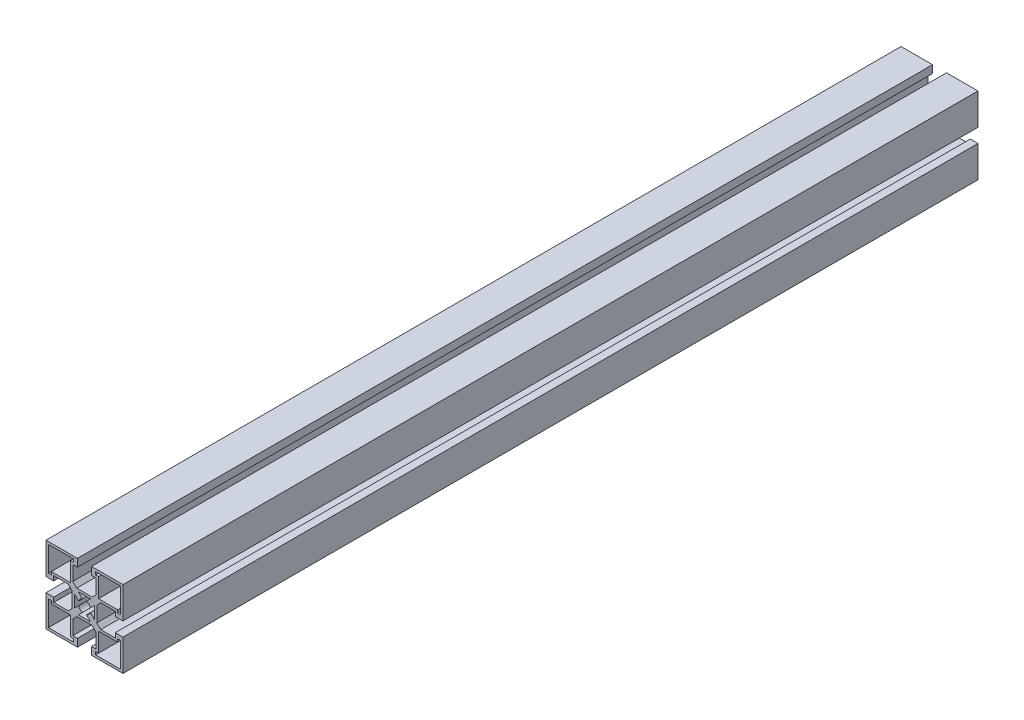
from build123d import *

# Parameters (mm, degrees)
EXTRUDE1_DEPTH      = 250
EXTRUDE1_DEPTH_BACK = 250
M8_TAPPED_HOLE1_D   = 6.8


with BuildPart() as part:
    # Sketch1 → Extrude1 (new, two sides: drawn at the far end of the back side and taken through both)
    with BuildSketch(Plane.XY.offset(-EXTRUDE1_DEPTH_BACK)):
        Polygon((-22.499997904, -22.500007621), (-4.099997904, -22.500007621), (-4.099997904, -18.000007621), (-6.799997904, -18.000007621), (-6.799997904, -9.500007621), (-4.499997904, -7.200007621), (4.500002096, -7.200007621), (6.800002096, -9.500007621), (6.800002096, -18.000007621), (4.100002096, -18.000007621), (4.100002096, -22.500007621), (22.500002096, -22.500007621), (22.500002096, -4.100007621), (18.000002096, -4.100007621), (18.000002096, -6.800007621), (9.500002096, -6.800007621), (7.200002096, -4.500007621), (7.200002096, 4.499992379), (9.500002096, 6.799992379), (18.000002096, 6.799992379), (18.000002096, 4.099992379), (22.500002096, 4.099992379), (22.500002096, 22.499992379), (4.100002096, 22.499992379), (4.100002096, 17.999992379), (6.800002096, 17.999992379), (6.800002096, 9.499992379), (4.500002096, 7.199992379), (-4.499997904, 7.199992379), (-6.799997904, 9.499992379), (-6.799997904, 17.999992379), (-4.099997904, 17.999992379), (-4.099997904, 22.499992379), (-22.499997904, 22.499992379), (-22.499997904, 4.099992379), (-17.999997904, 4.099992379), (-17.999997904, 6.799992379), (-9.499997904, 6.799992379), (-7.199997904, 4.499992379), (-7.199997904, -4.500007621), (-9.499997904, -6.800007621), (-17.999997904, -6.800007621), (-17.999997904, -4.100007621), (-22.499997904, -4.100007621), align=None)
        Polygon((8.200003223, 8.199980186), (8.199989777, 19.399992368), (6.500002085, 19.399992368), (6.500002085, 21.099984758), (21.100004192, 21.099984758), (21.100004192, 6.499980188), (19.400009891, 6.499980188), (19.400009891, 8.199980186), align=None, mode=Mode.SUBTRACT)
        Polygon((-19.399997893, 6.499992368), (-21.099990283, 6.499992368), (-21.099990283, 21.099994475), (-6.499974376, 21.099994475), (-6.49997587, 19.399985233), (-8.199975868, 19.399986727), (-8.199985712, 8.19998006), (-19.399997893, 8.19998006), align=None, mode=Mode.SUBTRACT)
        Polygon((-6.499997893, -21.1), (-21.1, -21.1), (-21.1, -6.499995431), (-19.400002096, -6.499995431), (-19.400002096, -8.199995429), (-8.199995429, -8.199995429), (-8.199995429, -19.40000761), (-6.499997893, -19.400009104), align=None, mode=Mode.SUBTRACT)
        Polygon((6.499989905, -19.400011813), (8.199989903, -19.400011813), (8.199989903, -8.200005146), (19.400002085, -8.200005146), (19.400003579, -6.500017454), (21.099994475, -6.500018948), (21.099994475, -21.100009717), (6.499989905, -21.100009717), align=None, mode=Mode.SUBTRACT)
        with BuildLine():
            Line((-5.799999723, 3.537265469), (-3.451121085, 1.18838683))
            ThreePointArc((-3.451121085, 1.18838683), (-2.580942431, 2.580937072), (-1.188393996, 3.451118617))
            Line((-1.188393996, 3.451118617), (-3.537277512, 5.799992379))
            Line((-3.537277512, 5.799992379), (3.537277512, 5.799992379))
            Line((3.537277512, 5.799992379), (1.188393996, 3.451118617))
            ThreePointArc((1.188393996, 3.451118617), (2.580942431, 2.580937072), (3.451121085, 1.18838683))
            Line((3.451121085, 1.18838683), (5.799999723, 3.537265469))
            Line((5.799999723, 3.537265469), (5.799985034, -3.537266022))
            Line((5.799985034, -3.537266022), (3.451117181, -1.188398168))
            ThreePointArc((3.451117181, -1.188398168), (2.580938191, -2.580941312), (1.188393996, -3.451118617))
            Line((1.188393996, -3.451118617), (3.537277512, -5.799992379))
            Line((3.537277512, -5.799992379), (-3.537277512, -5.799992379))
            Line((-3.537277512, -5.799992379), (-1.188393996, -3.451118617))
            ThreePointArc((-1.188393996, -3.451118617), (-2.580938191, -2.580941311), (-3.451117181, -1.188398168))
            Line((-3.451117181, -1.188398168), (-5.799985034, -3.537266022))
            Line((-5.799985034, -3.537266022), (-5.799999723, 3.537265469))
        make_face(mode=Mode.SUBTRACT)
    extrude(amount=EXTRUDE1_DEPTH + EXTRUDE1_DEPTH_BACK)

    # M8 Tapped Hole1 (through all)
    with Locations(Plane(origin=(2.096e-06, 22.499992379, 227.5), x_dir=(1, 0, 0), z_dir=(0, 1, 0))):
        with Locations((0, 0), (0, 455)):
            Hole(M8_TAPPED_HOLE1_D / 2)


solid = part.part
